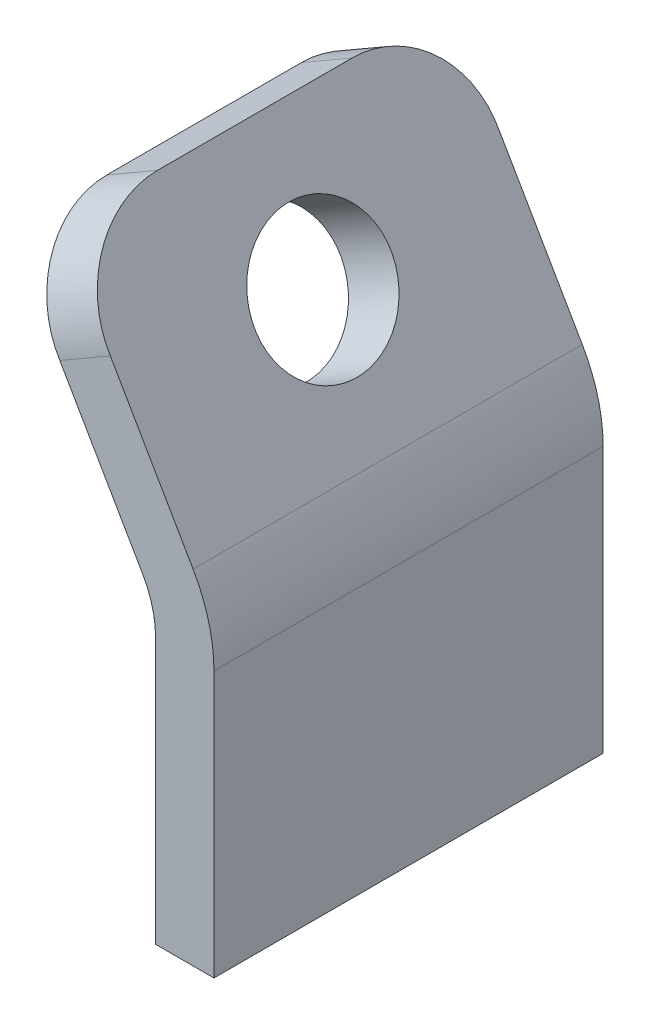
ISO-10303-21;
HEADER;
FILE_DESCRIPTION(('STEP AP214'),'2;1');
FILE_NAME('part.step','',(''),(''),'','','');
FILE_SCHEMA(('AUTOMOTIVE_DESIGN { 1 0 10303 214 1 1 1 1 }'));
ENDSEC;
DATA;
#1=APPLICATION_CONTEXT('core data for automotive mechanical design processes');
#2=APPLICATION_PROTOCOL_DEFINITION('international standard','automotive_design',2000,#1);
#3=PRODUCT_CONTEXT('',#1,'mechanical');
#4=PRODUCT('Part','Part','',(#3));
#5=PRODUCT_RELATED_PRODUCT_CATEGORY('part','',(#4));
#6=PRODUCT_DEFINITION_FORMATION('','',#4);
#7=PRODUCT_DEFINITION_CONTEXT('part definition',#1,'design');
#8=PRODUCT_DEFINITION('design','',#6,#7);
#9=PRODUCT_DEFINITION_SHAPE('','',#8);
#10=(LENGTH_UNIT() NAMED_UNIT(*) SI_UNIT(.MILLI.,.METRE.));
#11=(NAMED_UNIT(*) PLANE_ANGLE_UNIT() SI_UNIT($,.RADIAN.));
#12=(NAMED_UNIT(*) SI_UNIT($,.STERADIAN.) SOLID_ANGLE_UNIT());
#13=UNCERTAINTY_MEASURE_WITH_UNIT(LENGTH_MEASURE(1.E-05),#10,'distance_accuracy_value','');
#14=(GEOMETRIC_REPRESENTATION_CONTEXT(3) GLOBAL_UNCERTAINTY_ASSIGNED_CONTEXT((#13)) GLOBAL_UNIT_ASSIGNED_CONTEXT((#10,
#11,#12)) REPRESENTATION_CONTEXT('',''));
#15=CARTESIAN_POINT('',(0.,0.,0.));
#16=DIRECTION('',(0.,0.,1.));
#17=DIRECTION('',(1.,0.,0.));
#18=AXIS2_PLACEMENT_3D('',#15,#16,#17);
#19=CARTESIAN_POINT('',(-3.50000000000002,6.06217782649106,10.));
#20=DIRECTION('',(0.500000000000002,-0.866025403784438,0.));
#21=DIRECTION('',(0.866025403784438,0.500000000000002,0.));
#22=AXIS2_PLACEMENT_3D('',#19,#20,#21);
#23=PLANE('',#22);
#24=DIRECTION('',(0.866025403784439,0.5,0.));
#25=VECTOR('',#24,1.);
#26=CARTESIAN_POINT('',(-18.2182667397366,-2.43541743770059,-5.));
#27=LINE('',#26,#25);
#28=CARTESIAN_POINT('',(-6.09807621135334,4.56217782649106,-5.));
#29=VERTEX_POINT('',#28);
#30=CARTESIAN_POINT('',(-3.5,6.06217782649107,-5.));
#31=VERTEX_POINT('',#30);
#32=EDGE_CURVE('E123',#29,#31,#27,.T.);
#33=ORIENTED_EDGE('',*,*,#32,.F.);
#34=DIRECTION('',(0.,0.,-1.));
#35=VECTOR('',#34,1.);
#36=CARTESIAN_POINT('',(-6.09807621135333,4.56217782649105,10.));
#37=LINE('',#36,#35);
#38=CARTESIAN_POINT('',(-6.09807621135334,4.56217782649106,4.99999999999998));
#39=VERTEX_POINT('',#38);
#40=EDGE_CURVE('E244',#39,#29,#37,.T.);
#41=ORIENTED_EDGE('',*,*,#40,.F.);
#42=DIRECTION('',(0.866025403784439,0.5,0.));
#43=VECTOR('',#42,1.);
#44=CARTESIAN_POINT('',(-18.2182667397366,-2.43541743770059,4.99999999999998));
#45=LINE('',#44,#43);
#46=CARTESIAN_POINT('',(-3.5,6.06217782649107,4.99999999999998));
#47=VERTEX_POINT('',#46);
#48=EDGE_CURVE('E179',#39,#47,#45,.T.);
#49=ORIENTED_EDGE('',*,*,#48,.T.);
#50=DIRECTION('',(0.,0.,-1.));
#51=VECTOR('',#50,1.);
#52=CARTESIAN_POINT('',(-3.50000000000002,6.06217782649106,10.));
#53=LINE('',#52,#51);
#54=EDGE_CURVE('E226',#47,#31,#53,.T.);
#55=ORIENTED_EDGE('',*,*,#54,.T.);
#56=EDGE_LOOP('',(#33,#41,#49,#55));
#57=FACE_BOUND('',#56,.T.);
#58=ADVANCED_FACE('F30',(#57),#23,.F.);
#59=CARTESIAN_POINT('',(-6.09807621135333,4.56217782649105,10.));
#60=DIRECTION('',(0.866025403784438,0.500000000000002,0.));
#61=DIRECTION('',(-0.500000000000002,0.866025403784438,0.));
#62=AXIS2_PLACEMENT_3D('',#59,#60,#61);
#63=PLANE('',#62);
#64=CARTESIAN_POINT('',(-2.59807621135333,-1.50000000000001,0.));
#65=DIRECTION('',(0.866025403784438,0.500000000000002,0.));
#66=DIRECTION('',(-0.500000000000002,0.866025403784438,0.));
#67=AXIS2_PLACEMENT_3D('',#64,#65,#66);
#68=CIRCLE('',#67,3.5);
#69=CARTESIAN_POINT('',(-4.34807621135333,1.53108891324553,0.));
#70=VERTEX_POINT('',#69);
#71=EDGE_CURVE('E193',#70,#70,#68,.T.);
#72=ORIENTED_EDGE('',*,*,#71,.T.);
#73=EDGE_LOOP('',(#72));
#74=FACE_BOUND('',#73,.T.);
#75=ORIENTED_EDGE('',*,*,#40,.T.);
#76=CARTESIAN_POINT('',(-3.59807621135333,0.23205080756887,-5.));
#77=DIRECTION('',(0.866025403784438,0.500000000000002,0.));
#78=DIRECTION('',(-0.500000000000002,0.866025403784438,0.));
#79=AXIS2_PLACEMENT_3D('',#76,#77,#78);
#80=CIRCLE('',#79,5.);
#81=CARTESIAN_POINT('',(-3.51318869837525,0.0850213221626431,-9.9971168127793));
#82=VERTEX_POINT('',#81);
#83=EDGE_CURVE('E282',#82,#29,#80,.T.);
#84=ORIENTED_EDGE('',*,*,#83,.F.);
#85=CARTESIAN_POINT('',(-6.09807621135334,4.56217782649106,-5.));
#86=CARTESIAN_POINT('',(-6.55259971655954,5.3494356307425,-7.57340954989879));
#87=CARTESIAN_POINT('',(-7.47419942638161,6.94569315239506,-12.7912992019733));
#88=CARTESIAN_POINT('',(-4.84546056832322,2.39258389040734,-10.9369301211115));
#89=CARTESIAN_POINT('',(-3.51318869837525,0.0850213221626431,-9.9971168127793));
#90=B_SPLINE_CURVE_WITH_KNOTS('',3,(#85,#86,#87,#88,#89),.UNSPECIFIED.,.F.,.F.,(4,1,4),(0.,
0.493189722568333,1.),.UNSPECIFIED.);
#91=CARTESIAN_POINT('',(-3.5172758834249,0.0921005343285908,-10.0000000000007));
#92=VERTEX_POINT('',#91);
#93=EDGE_CURVE('E120',#92,#82,#90,.T.);
#94=ORIENTED_EDGE('',*,*,#93,.F.);
#95=DIRECTION('',(0.500000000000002,-0.866025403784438,0.));
#96=VECTOR('',#95,1.);
#97=CARTESIAN_POINT('',(-6.09807621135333,4.56217782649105,-10.));
#98=LINE('',#97,#96);
#99=CARTESIAN_POINT('',(0.732050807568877,-7.26794919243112,-10.));
#100=VERTEX_POINT('',#99);
#101=EDGE_CURVE('E196',#92,#100,#98,.T.);
#102=ORIENTED_EDGE('',*,*,#101,.T.);
#103=DIRECTION('',(0.,0.,-1.));
#104=VECTOR('',#103,1.);
#105=CARTESIAN_POINT('',(0.732050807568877,-7.26794919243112,10.));
#106=LINE('',#105,#104);
#107=CARTESIAN_POINT('',(0.732050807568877,-7.26794919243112,10.));
#108=VERTEX_POINT('',#107);
#109=EDGE_CURVE('E241',#108,#100,#106,.T.);
#110=ORIENTED_EDGE('',*,*,#109,.F.);
#111=DIRECTION('',(0.500000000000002,-0.866025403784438,0.));
#112=VECTOR('',#111,1.);
#113=CARTESIAN_POINT('',(-6.09807621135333,4.56217782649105,10.));
#114=LINE('',#113,#112);
#115=CARTESIAN_POINT('',(-3.51727588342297,0.0921005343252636,10.));
#116=VERTEX_POINT('',#115);
#117=EDGE_CURVE('E210',#116,#108,#114,.T.);
#118=ORIENTED_EDGE('',*,*,#117,.F.);
#119=CARTESIAN_POINT('',(-3.51318869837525,0.0850213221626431,9.9971168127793));
#120=CARTESIAN_POINT('',(-4.84546056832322,2.39258389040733,10.9369301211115));
#121=CARTESIAN_POINT('',(-7.47419942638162,6.94569315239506,12.7912992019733));
#122=CARTESIAN_POINT('',(-6.55259971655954,5.3494356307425,7.57340954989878));
#123=CARTESIAN_POINT('',(-6.09807621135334,4.56217782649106,4.99999999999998));
#124=B_SPLINE_CURVE_WITH_KNOTS('',3,(#119,#120,#121,#122,#123),.UNSPECIFIED.,.F.,.F.,(4,1,4),
(0.,0.506810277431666,1.),.UNSPECIFIED.);
#125=CARTESIAN_POINT('',(-3.51318869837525,0.0850213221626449,9.9971168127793));
#126=VERTEX_POINT('',#125);
#127=EDGE_CURVE('E51',#126,#116,#124,.T.);
#128=ORIENTED_EDGE('',*,*,#127,.F.);
#129=CARTESIAN_POINT('',(-3.59807621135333,0.23205080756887,5.));
#130=DIRECTION('',(0.866025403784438,0.500000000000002,0.));
#131=DIRECTION('',(-0.500000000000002,0.866025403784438,0.));
#132=AXIS2_PLACEMENT_3D('',#129,#130,#131);
#133=CIRCLE('',#132,5.);
#134=EDGE_CURVE('E185',#39,#126,#133,.T.);
#135=ORIENTED_EDGE('',*,*,#134,.F.);
#136=EDGE_LOOP('',(#75,#84,#94,#102,#110,#118,#128,#135));
#137=FACE_BOUND('',#136,.T.);
#138=ADVANCED_FACE('F255',(#74,#137),#63,.F.);
#139=CARTESIAN_POINT('',(3.33012701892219,-5.76794919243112,10.));
#140=DIRECTION('',(-0.866025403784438,-0.500000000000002,0.));
#141=DIRECTION('',(0.500000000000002,-0.866025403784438,0.));
#142=AXIS2_PLACEMENT_3D('',#139,#140,#141);
#143=PLANE('',#142);
#144=CARTESIAN_POINT('',(0.,0.,0.));
#145=DIRECTION('',(0.866025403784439,0.5,0.));
#146=DIRECTION('',(-0.5,0.866025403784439,0.));
#147=AXIS2_PLACEMENT_3D('',#144,#145,#146);
#148=CIRCLE('',#147,3.5);
#149=CARTESIAN_POINT('',(-1.75,3.03108891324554,0.));
#150=VERTEX_POINT('',#149);
#151=EDGE_CURVE('E190',#150,#150,#148,.T.);
#152=ORIENTED_EDGE('',*,*,#151,.F.);
#153=EDGE_LOOP('',(#152));
#154=FACE_BOUND('',#153,.T.);
#155=CARTESIAN_POINT('',(-3.5,6.06217782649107,-5.));
#156=CARTESIAN_POINT('',(-3.9545235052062,6.84943563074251,-7.57340954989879));
#157=CARTESIAN_POINT('',(-4.87612321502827,8.44569315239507,-12.7912992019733));
#158=CARTESIAN_POINT('',(-2.24738435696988,3.89258389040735,-10.9369301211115));
#159=CARTESIAN_POINT('',(-0.915112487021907,1.58502132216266,-9.9971168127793));
#160=B_SPLINE_CURVE_WITH_KNOTS('',3,(#155,#156,#157,#158,#159),.UNSPECIFIED.,.F.,.F.,(4,1,4),
(0.,0.493189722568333,1.),.UNSPECIFIED.);
#161=CARTESIAN_POINT('',(-0.919199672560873,1.59210053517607,-10.));
#162=VERTEX_POINT('',#161);
#163=CARTESIAN_POINT('',(-0.915112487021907,1.58502132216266,-9.9971168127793));
#164=VERTEX_POINT('',#163);
#165=EDGE_CURVE('E43',#162,#164,#160,.T.);
#166=ORIENTED_EDGE('',*,*,#165,.T.);
#167=CARTESIAN_POINT('',(-1.,1.73205080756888,-5.));
#168=DIRECTION('',(0.866025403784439,0.5,0.));
#169=DIRECTION('',(-0.5,0.866025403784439,0.));
#170=AXIS2_PLACEMENT_3D('',#167,#168,#169);
#171=CIRCLE('',#170,5.);
#172=EDGE_CURVE('E126',#164,#31,#171,.T.);
#173=ORIENTED_EDGE('',*,*,#172,.T.);
#174=ORIENTED_EDGE('',*,*,#54,.F.);
#175=CARTESIAN_POINT('',(-1.,1.73205080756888,5.));
#176=DIRECTION('',(0.866025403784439,0.5,0.));
#177=DIRECTION('',(-0.5,0.866025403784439,0.));
#178=AXIS2_PLACEMENT_3D('',#175,#176,#177);
#179=CIRCLE('',#178,5.);
#180=CARTESIAN_POINT('',(-0.915112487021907,1.58502132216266,9.9971168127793));
#181=VERTEX_POINT('',#180);
#182=EDGE_CURVE('E171',#47,#181,#179,.T.);
#183=ORIENTED_EDGE('',*,*,#182,.T.);
#184=CARTESIAN_POINT('',(-0.915112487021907,1.58502132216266,9.9971168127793));
#185=CARTESIAN_POINT('',(-2.24738435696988,3.89258389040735,10.9369301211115));
#186=CARTESIAN_POINT('',(-4.87612321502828,8.44569315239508,12.7912992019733));
#187=CARTESIAN_POINT('',(-3.95452350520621,6.84943563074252,7.57340954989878));
#188=CARTESIAN_POINT('',(-3.5,6.06217782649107,4.99999999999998));
#189=B_SPLINE_CURVE_WITH_KNOTS('',3,(#184,#185,#186,#187,#188),.UNSPECIFIED.,.F.,.F.,(4,1,4),
(0.,0.506810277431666,1.),.UNSPECIFIED.);
#190=CARTESIAN_POINT('',(-0.919199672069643,1.59210053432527,10.));
#191=VERTEX_POINT('',#190);
#192=EDGE_CURVE('E281',#181,#191,#189,.T.);
#193=ORIENTED_EDGE('',*,*,#192,.T.);
#194=DIRECTION('',(-0.500000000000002,0.866025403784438,0.));
#195=VECTOR('',#194,1.);
#196=CARTESIAN_POINT('',(3.33012701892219,-5.76794919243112,10.));
#197=LINE('',#196,#195);
#198=CARTESIAN_POINT('',(3.33012701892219,-5.76794919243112,10.));
#199=VERTEX_POINT('',#198);
#200=EDGE_CURVE('E223',#199,#191,#197,.T.);
#201=ORIENTED_EDGE('',*,*,#200,.F.);
#202=DIRECTION('',(0.,0.,-1.));
#203=VECTOR('',#202,1.);
#204=CARTESIAN_POINT('',(3.33012701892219,-5.76794919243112,10.));
#205=LINE('',#204,#203);
#206=CARTESIAN_POINT('',(3.33012701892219,-5.76794919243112,-10.));
#207=VERTEX_POINT('',#206);
#208=EDGE_CURVE('E228',#199,#207,#205,.T.);
#209=ORIENTED_EDGE('',*,*,#208,.T.);
#210=DIRECTION('',(-0.500000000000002,0.866025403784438,0.));
#211=VECTOR('',#210,1.);
#212=CARTESIAN_POINT('',(3.33012701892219,-5.76794919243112,-10.));
#213=LINE('',#212,#211);
#214=EDGE_CURVE('E137',#207,#162,#213,.T.);
#215=ORIENTED_EDGE('',*,*,#214,.T.);
#216=EDGE_LOOP('',(#166,#173,#174,#183,#193,#201,#209,#215));
#217=FACE_BOUND('',#216,.T.);
#218=ADVANCED_FACE('F134',(#154,#217),#143,.F.);
#219=CARTESIAN_POINT('',(-3.59807621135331,-9.76794919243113,-10.));
#220=DIRECTION('',(0.,0.,1.));
#221=DIRECTION('',(1.,0.,0.));
#222=AXIS2_PLACEMENT_3D('',#219,#220,#221);
#223=PLANE('',#222);
#224=DIRECTION('',(0.866025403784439,0.5,0.));
#225=VECTOR('',#224,1.);
#226=CARTESIAN_POINT('',(-15.6374664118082,-6.90549472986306,-10.0000000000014));
#227=LINE('',#226,#225);
#228=EDGE_CURVE('E11',#162,#92,#227,.F.);
#229=ORIENTED_EDGE('',*,*,#228,.F.);
#230=ORIENTED_EDGE('',*,*,#214,.F.);
#231=CARTESIAN_POINT('',(-3.59807621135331,-9.76794919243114,-10.));
#232=DIRECTION('',(0.,0.,1.));
#233=DIRECTION('',(1.,0.,0.));
#234=AXIS2_PLACEMENT_3D('',#231,#232,#233);
#235=CIRCLE('',#234,8.);
#236=CARTESIAN_POINT('',(4.40192378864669,-9.76794919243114,-10.));
#237=VERTEX_POINT('',#236);
#238=EDGE_CURVE('E207',#237,#207,#235,.T.);
#239=ORIENTED_EDGE('',*,*,#238,.F.);
#240=DIRECTION('',(0.,1.,0.));
#241=VECTOR('',#240,1.);
#242=CARTESIAN_POINT('',(4.40192378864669,-23.4282032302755,-10.));
#243=LINE('',#242,#241);
#244=CARTESIAN_POINT('',(4.40192378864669,-23.4282032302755,-10.));
#245=VERTEX_POINT('',#244);
#246=EDGE_CURVE('E205',#245,#237,#243,.T.);
#247=ORIENTED_EDGE('',*,*,#246,.F.);
#248=DIRECTION('',(1.,0.,0.));
#249=VECTOR('',#248,1.);
#250=CARTESIAN_POINT('',(1.40192378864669,-23.4282032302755,-10.));
#251=LINE('',#250,#249);
#252=CARTESIAN_POINT('',(1.40192378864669,-23.4282032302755,-10.));
#253=VERTEX_POINT('',#252);
#254=EDGE_CURVE('E203',#253,#245,#251,.T.);
#255=ORIENTED_EDGE('',*,*,#254,.F.);
#256=DIRECTION('',(0.,-1.,0.));
#257=VECTOR('',#256,1.);
#258=CARTESIAN_POINT('',(1.40192378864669,-9.76794919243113,-10.));
#259=LINE('',#258,#257);
#260=CARTESIAN_POINT('',(1.40192378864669,-9.76794919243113,-10.));
#261=VERTEX_POINT('',#260);
#262=EDGE_CURVE('E201',#261,#253,#259,.T.);
#263=ORIENTED_EDGE('',*,*,#262,.F.);
#264=CARTESIAN_POINT('',(-3.59807621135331,-9.76794919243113,-10.));
#265=DIRECTION('',(0.,0.,1.));
#266=DIRECTION('',(1.,0.,0.));
#267=AXIS2_PLACEMENT_3D('',#264,#265,#266);
#268=CIRCLE('',#267,5.);
#269=EDGE_CURVE('E198',#261,#100,#268,.T.);
#270=ORIENTED_EDGE('',*,*,#269,.T.);
#271=ORIENTED_EDGE('',*,*,#101,.F.);
#272=EDGE_LOOP('',(#229,#230,#239,#247,#255,#263,#270,#271));
#273=FACE_BOUND('',#272,.T.);
#274=ADVANCED_FACE('F305',(#273),#223,.F.);
#275=CARTESIAN_POINT('',(-3.59807621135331,-9.76794919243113,10.));
#276=DIRECTION('',(0.,0.,1.));
#277=DIRECTION('',(1.,0.,0.));
#278=AXIS2_PLACEMENT_3D('',#275,#276,#277);
#279=PLANE('',#278);
#280=ORIENTED_EDGE('',*,*,#200,.T.);
#281=DIRECTION('',(0.866025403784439,0.5,0.));
#282=VECTOR('',#281,1.);
#283=CARTESIAN_POINT('',(-15.6374664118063,-6.90549472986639,10.));
#284=LINE('',#283,#282);
#285=EDGE_CURVE('E37',#191,#116,#284,.F.);
#286=ORIENTED_EDGE('',*,*,#285,.T.);
#287=ORIENTED_EDGE('',*,*,#117,.T.);
#288=CARTESIAN_POINT('',(-3.59807621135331,-9.76794919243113,10.));
#289=DIRECTION('',(0.,0.,1.));
#290=DIRECTION('',(1.,0.,0.));
#291=AXIS2_PLACEMENT_3D('',#288,#289,#290);
#292=CIRCLE('',#291,5.);
#293=CARTESIAN_POINT('',(1.40192378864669,-9.76794919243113,10.));
#294=VERTEX_POINT('',#293);
#295=EDGE_CURVE('E212',#294,#108,#292,.T.);
#296=ORIENTED_EDGE('',*,*,#295,.F.);
#297=DIRECTION('',(0.,-1.,0.));
#298=VECTOR('',#297,1.);
#299=CARTESIAN_POINT('',(1.40192378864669,-9.76794919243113,10.));
#300=LINE('',#299,#298);
#301=CARTESIAN_POINT('',(1.40192378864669,-23.4282032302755,10.));
#302=VERTEX_POINT('',#301);
#303=EDGE_CURVE('E215',#294,#302,#300,.T.);
#304=ORIENTED_EDGE('',*,*,#303,.T.);
#305=DIRECTION('',(1.,0.,0.));
#306=VECTOR('',#305,1.);
#307=CARTESIAN_POINT('',(1.40192378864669,-23.4282032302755,10.));
#308=LINE('',#307,#306);
#309=CARTESIAN_POINT('',(4.40192378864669,-23.4282032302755,10.));
#310=VERTEX_POINT('',#309);
#311=EDGE_CURVE('E217',#302,#310,#308,.T.);
#312=ORIENTED_EDGE('',*,*,#311,.T.);
#313=DIRECTION('',(0.,1.,0.));
#314=VECTOR('',#313,1.);
#315=CARTESIAN_POINT('',(4.40192378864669,-23.4282032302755,10.));
#316=LINE('',#315,#314);
#317=CARTESIAN_POINT('',(4.40192378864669,-9.76794919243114,10.));
#318=VERTEX_POINT('',#317);
#319=EDGE_CURVE('E219',#310,#318,#316,.T.);
#320=ORIENTED_EDGE('',*,*,#319,.T.);
#321=CARTESIAN_POINT('',(-3.59807621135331,-9.76794919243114,10.));
#322=DIRECTION('',(0.,0.,1.));
#323=DIRECTION('',(1.,0.,0.));
#324=AXIS2_PLACEMENT_3D('',#321,#322,#323);
#325=CIRCLE('',#324,8.);
#326=EDGE_CURVE('E221',#318,#199,#325,.T.);
#327=ORIENTED_EDGE('',*,*,#326,.T.);
#328=EDGE_LOOP('',(#280,#286,#287,#296,#304,#312,#320,#327));
#329=FACE_BOUND('',#328,.T.);
#330=ADVANCED_FACE('F248',(#329),#279,.T.);
#331=CARTESIAN_POINT('',(-3.59807621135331,-9.76794919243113,10.));
#332=DIRECTION('',(0.,0.,-1.));
#333=DIRECTION('',(-1.,0.,0.));
#334=AXIS2_PLACEMENT_3D('',#331,#332,#333);
#335=CYLINDRICAL_SURFACE('',#334,5.);
#336=ORIENTED_EDGE('',*,*,#269,.F.);
#337=DIRECTION('',(0.,0.,-1.));
#338=VECTOR('',#337,1.);
#339=CARTESIAN_POINT('',(1.40192378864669,-9.76794919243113,10.));
#340=LINE('',#339,#338);
#341=EDGE_CURVE('E239',#294,#261,#340,.T.);
#342=ORIENTED_EDGE('',*,*,#341,.F.);
#343=ORIENTED_EDGE('',*,*,#295,.T.);
#344=ORIENTED_EDGE('',*,*,#109,.T.);
#345=EDGE_LOOP('',(#336,#342,#343,#344));
#346=FACE_BOUND('',#345,.T.);
#347=ADVANCED_FACE('F260',(#346),#335,.F.);
#348=CARTESIAN_POINT('',(1.40192378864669,-9.76794919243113,10.));
#349=DIRECTION('',(1.,0.,0.));
#350=DIRECTION('',(0.,1.,0.));
#351=AXIS2_PLACEMENT_3D('',#348,#349,#350);
#352=PLANE('',#351);
#353=ORIENTED_EDGE('',*,*,#262,.T.);
#354=DIRECTION('',(0.,0.,-1.));
#355=VECTOR('',#354,1.);
#356=CARTESIAN_POINT('',(1.40192378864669,-23.4282032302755,10.));
#357=LINE('',#356,#355);
#358=EDGE_CURVE('E236',#302,#253,#357,.T.);
#359=ORIENTED_EDGE('',*,*,#358,.F.);
#360=ORIENTED_EDGE('',*,*,#303,.F.);
#361=ORIENTED_EDGE('',*,*,#341,.T.);
#362=EDGE_LOOP('',(#353,#359,#360,#361));
#363=FACE_BOUND('',#362,.T.);
#364=ADVANCED_FACE('F266',(#363),#352,.F.);
#365=CARTESIAN_POINT('',(1.40192378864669,-23.4282032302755,10.));
#366=DIRECTION('',(0.,1.,0.));
#367=DIRECTION('',(0.,0.,1.));
#368=AXIS2_PLACEMENT_3D('',#365,#366,#367);
#369=PLANE('',#368);
#370=ORIENTED_EDGE('',*,*,#254,.T.);
#371=DIRECTION('',(0.,0.,-1.));
#372=VECTOR('',#371,1.);
#373=CARTESIAN_POINT('',(4.40192378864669,-23.4282032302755,10.));
#374=LINE('',#373,#372);
#375=EDGE_CURVE('E233',#310,#245,#374,.T.);
#376=ORIENTED_EDGE('',*,*,#375,.F.);
#377=ORIENTED_EDGE('',*,*,#311,.F.);
#378=ORIENTED_EDGE('',*,*,#358,.T.);
#379=EDGE_LOOP('',(#370,#376,#377,#378));
#380=FACE_BOUND('',#379,.T.);
#381=ADVANCED_FACE('F270',(#380),#369,.F.);
#382=CARTESIAN_POINT('',(4.40192378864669,-23.4282032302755,10.));
#383=DIRECTION('',(-1.,0.,0.));
#384=DIRECTION('',(0.,0.,1.));
#385=AXIS2_PLACEMENT_3D('',#382,#383,#384);
#386=PLANE('',#385);
#387=ORIENTED_EDGE('',*,*,#246,.T.);
#388=DIRECTION('',(0.,0.,-1.));
#389=VECTOR('',#388,1.);
#390=CARTESIAN_POINT('',(4.40192378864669,-9.76794919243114,10.));
#391=LINE('',#390,#389);
#392=EDGE_CURVE('E230',#318,#237,#391,.T.);
#393=ORIENTED_EDGE('',*,*,#392,.F.);
#394=ORIENTED_EDGE('',*,*,#319,.F.);
#395=ORIENTED_EDGE('',*,*,#375,.T.);
#396=EDGE_LOOP('',(#387,#393,#394,#395));
#397=FACE_BOUND('',#396,.T.);
#398=ADVANCED_FACE('F275',(#397),#386,.F.);
#399=CARTESIAN_POINT('',(-3.59807621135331,-9.76794919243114,10.));
#400=DIRECTION('',(0.,0.,-1.));
#401=DIRECTION('',(-1.,0.,0.));
#402=AXIS2_PLACEMENT_3D('',#399,#400,#401);
#403=CYLINDRICAL_SURFACE('',#402,8.);
#404=ORIENTED_EDGE('',*,*,#238,.T.);
#405=ORIENTED_EDGE('',*,*,#208,.F.);
#406=ORIENTED_EDGE('',*,*,#326,.F.);
#407=ORIENTED_EDGE('',*,*,#392,.T.);
#408=EDGE_LOOP('',(#404,#405,#406,#407));
#409=FACE_BOUND('',#408,.T.);
#410=ADVANCED_FACE('F279',(#409),#403,.T.);
#411=CARTESIAN_POINT('',(-14.7182667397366,-8.49759526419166,0.));
#412=DIRECTION('',(0.866025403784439,0.5,0.));
#413=DIRECTION('',(-0.5,0.866025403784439,0.));
#414=AXIS2_PLACEMENT_3D('',#411,#412,#413);
#415=CYLINDRICAL_SURFACE('',#414,3.5);
#416=ORIENTED_EDGE('',*,*,#151,.T.);
#417=EDGE_LOOP('',(#416));
#418=FACE_BOUND('',#417,.T.);
#419=ORIENTED_EDGE('',*,*,#71,.F.);
#420=EDGE_LOOP('',(#419));
#421=FACE_BOUND('',#420,.T.);
#422=ADVANCED_FACE('F160',(#418,#421),#415,.F.);
#423=CARTESIAN_POINT('',(-15.7182667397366,-6.76554445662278,5.));
#424=DIRECTION('',(0.866025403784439,0.5,0.));
#425=DIRECTION('',(-0.5,0.866025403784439,0.));
#426=AXIS2_PLACEMENT_3D('',#423,#424,#425);
#427=CYLINDRICAL_SURFACE('',#426,5.);
#428=ORIENTED_EDGE('',*,*,#134,.T.);
#429=DIRECTION('',(0.866025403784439,0.5,0.));
#430=VECTOR('',#429,1.);
#431=CARTESIAN_POINT('',(-15.6333792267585,-6.912573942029,9.9971168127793));
#432=LINE('',#431,#430);
#433=EDGE_CURVE('E173',#126,#181,#432,.T.);
#434=ORIENTED_EDGE('',*,*,#433,.T.);
#435=ORIENTED_EDGE('',*,*,#182,.F.);
#436=ORIENTED_EDGE('',*,*,#48,.F.);
#437=EDGE_LOOP('',(#428,#434,#435,#436));
#438=FACE_BOUND('',#437,.T.);
#439=ADVANCED_FACE('F156',(#438),#427,.T.);
#440=CARTESIAN_POINT('',(-15.6333792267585,-6.912573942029,9.9971168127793));
#441=CARTESIAN_POINT('',(-16.9656510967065,-4.60501137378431,10.9369301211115));
#442=CARTESIAN_POINT('',(-19.5943899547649,-0.0519021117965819,12.7912992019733));
#443=CARTESIAN_POINT('',(-18.6727902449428,-1.64815963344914,7.57340954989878));
#444=CARTESIAN_POINT('',(-18.2182667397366,-2.43541743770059,4.99999999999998));
#445=B_SPLINE_CURVE_WITH_KNOTS('',3,(#440,#441,#442,#443,#444),.UNSPECIFIED.,.F.,.F.,(4,1,4),
(0.,0.506810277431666,1.),.UNSPECIFIED.);
#446=DIRECTION('',(0.866025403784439,0.5,0.));
#447=VECTOR('',#446,1.);
#448=SURFACE_OF_LINEAR_EXTRUSION('',#445,#447);
#449=ORIENTED_EDGE('',*,*,#127,.T.);
#450=ORIENTED_EDGE('',*,*,#285,.F.);
#451=ORIENTED_EDGE('',*,*,#192,.F.);
#452=ORIENTED_EDGE('',*,*,#433,.F.);
#453=EDGE_LOOP('',(#449,#450,#451,#452));
#454=FACE_BOUND('',#453,.T.);
#455=ADVANCED_FACE('F159',(#454),#448,.T.);
#456=CARTESIAN_POINT('',(-15.7182667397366,-6.76554445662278,-5.));
#457=DIRECTION('',(0.866025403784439,0.5,0.));
#458=DIRECTION('',(-0.5,0.866025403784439,0.));
#459=AXIS2_PLACEMENT_3D('',#456,#457,#458);
#460=CYLINDRICAL_SURFACE('',#459,5.);
#461=ORIENTED_EDGE('',*,*,#83,.T.);
#462=ORIENTED_EDGE('',*,*,#32,.T.);
#463=ORIENTED_EDGE('',*,*,#172,.F.);
#464=DIRECTION('',(0.866025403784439,0.5,0.));
#465=VECTOR('',#464,1.);
#466=CARTESIAN_POINT('',(-15.6333792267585,-6.912573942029,-9.9971168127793));
#467=LINE('',#466,#465);
#468=EDGE_CURVE('E116',#82,#164,#467,.T.);
#469=ORIENTED_EDGE('',*,*,#468,.F.);
#470=EDGE_LOOP('',(#461,#462,#463,#469));
#471=FACE_BOUND('',#470,.T.);
#472=ADVANCED_FACE('F127',(#471),#460,.T.);
#473=CARTESIAN_POINT('',(-18.2182667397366,-2.43541743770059,-5.));
#474=CARTESIAN_POINT('',(-18.6727902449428,-1.64815963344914,-7.57340954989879));
#475=CARTESIAN_POINT('',(-19.5943899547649,-0.0519021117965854,-12.7912992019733));
#476=CARTESIAN_POINT('',(-16.9656510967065,-4.60501137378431,-10.9369301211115));
#477=CARTESIAN_POINT('',(-15.6333792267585,-6.912573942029,-9.9971168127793));
#478=B_SPLINE_CURVE_WITH_KNOTS('',3,(#473,#474,#475,#476,#477),.UNSPECIFIED.,.F.,.F.,(4,1,4),
(0.,0.493189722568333,1.),.UNSPECIFIED.);
#479=DIRECTION('',(0.866025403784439,0.5,0.));
#480=VECTOR('',#479,1.);
#481=SURFACE_OF_LINEAR_EXTRUSION('',#478,#480);
#482=ORIENTED_EDGE('',*,*,#93,.T.);
#483=ORIENTED_EDGE('',*,*,#468,.T.);
#484=ORIENTED_EDGE('',*,*,#165,.F.);
#485=ORIENTED_EDGE('',*,*,#228,.T.);
#486=EDGE_LOOP('',(#482,#483,#484,#485));
#487=FACE_BOUND('',#486,.T.);
#488=ADVANCED_FACE('F118',(#487),#481,.T.);
#489=CLOSED_SHELL('',(#58,#138,#218,#274,#330,#347,#364,#381,#398,#410,#422,#439,#455,#472,#488));
#490=MANIFOLD_SOLID_BREP('B2',#489);
#491=ADVANCED_BREP_SHAPE_REPRESENTATION('',(#18,#490),#14);
#492=SHAPE_DEFINITION_REPRESENTATION(#9,#491);
ENDSEC;
END-ISO-10303-21;
